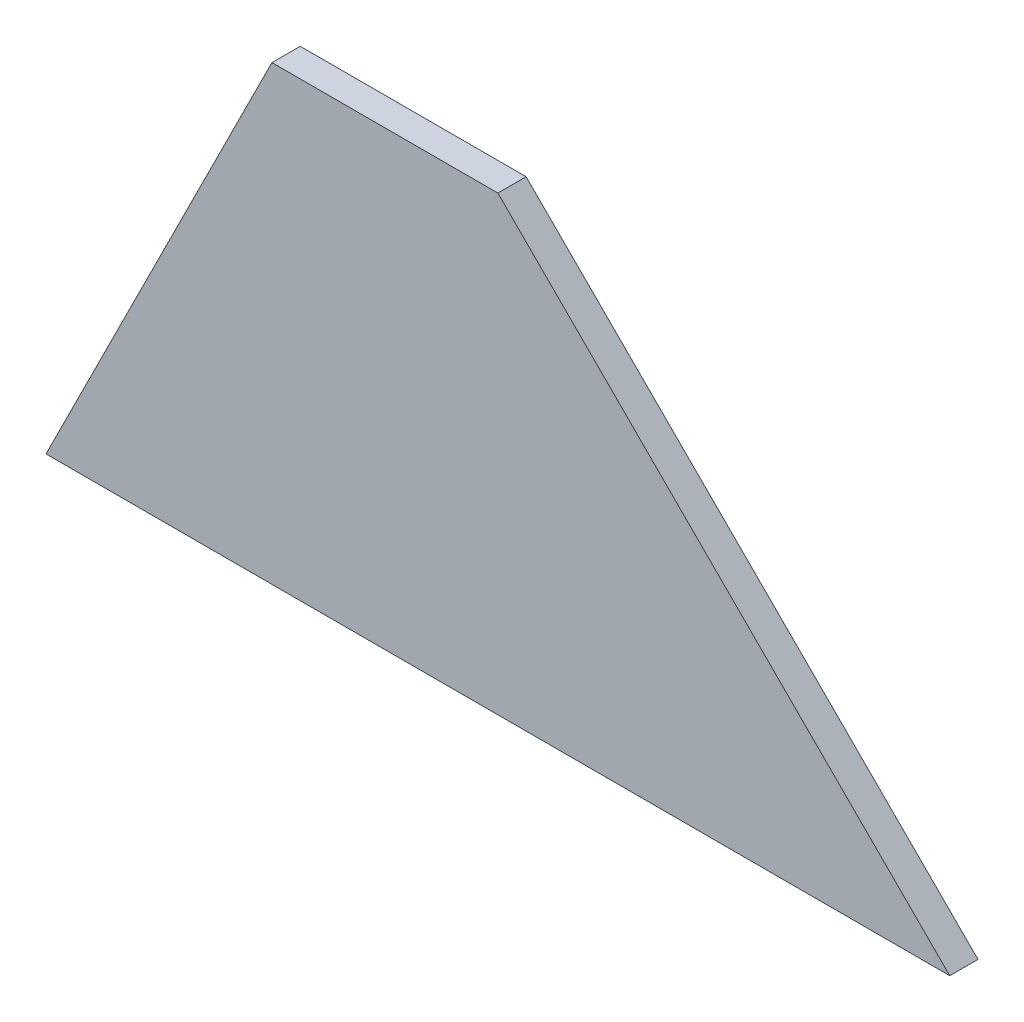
ISO-10303-21;
HEADER;
FILE_DESCRIPTION(('STEP AP214'),'2;1');
FILE_NAME('part.step','',(''),(''),'','','');
FILE_SCHEMA(('AUTOMOTIVE_DESIGN { 1 0 10303 214 1 1 1 1 }'));
ENDSEC;
DATA;
#1=APPLICATION_CONTEXT('core data for automotive mechanical design processes');
#2=APPLICATION_PROTOCOL_DEFINITION('international standard','automotive_design',2000,#1);
#3=PRODUCT_CONTEXT('',#1,'mechanical');
#4=PRODUCT('Part','Part','',(#3));
#5=PRODUCT_RELATED_PRODUCT_CATEGORY('part','',(#4));
#6=PRODUCT_DEFINITION_FORMATION('','',#4);
#7=PRODUCT_DEFINITION_CONTEXT('part definition',#1,'design');
#8=PRODUCT_DEFINITION('design','',#6,#7);
#9=PRODUCT_DEFINITION_SHAPE('','',#8);
#10=(LENGTH_UNIT() NAMED_UNIT(*) SI_UNIT(.MILLI.,.METRE.));
#11=(NAMED_UNIT(*) PLANE_ANGLE_UNIT() SI_UNIT($,.RADIAN.));
#12=(NAMED_UNIT(*) SI_UNIT($,.STERADIAN.) SOLID_ANGLE_UNIT());
#13=UNCERTAINTY_MEASURE_WITH_UNIT(LENGTH_MEASURE(1.E-05),#10,'distance_accuracy_value','');
#14=(GEOMETRIC_REPRESENTATION_CONTEXT(3) GLOBAL_UNCERTAINTY_ASSIGNED_CONTEXT((#13)) GLOBAL_UNIT_ASSIGNED_CONTEXT((#10,
#11,#12)) REPRESENTATION_CONTEXT('',''));
#15=CARTESIAN_POINT('',(0.,0.,0.));
#16=DIRECTION('',(0.,0.,1.));
#17=DIRECTION('',(1.,0.,0.));
#18=AXIS2_PLACEMENT_3D('',#15,#16,#17);
#19=CARTESIAN_POINT('',(-16.933333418,16.9333333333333,1.05833333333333));
#20=DIRECTION('',(-0.707106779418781,-0.707106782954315,0.));
#21=DIRECTION('',(0.707106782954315,-0.707106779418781,0.));
#22=AXIS2_PLACEMENT_3D('',#19,#20,#21);
#23=PLANE('',#22);
#24=DIRECTION('',(-0.707106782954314,0.70710677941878,0.));
#25=VECTOR('',#24,1.);
#26=CARTESIAN_POINT('',(-16.933333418,16.9333333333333,0.));
#27=LINE('',#26,#25);
#28=CARTESIAN_POINT('',(0.,0.,0.));
#29=VERTEX_POINT('',#28);
#30=CARTESIAN_POINT('',(-16.933333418,16.9333333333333,0.));
#31=VERTEX_POINT('',#30);
#32=EDGE_CURVE('E75',#29,#31,#27,.T.);
#33=ORIENTED_EDGE('',*,*,#32,.T.);
#34=DIRECTION('',(0.,0.,-1.));
#35=VECTOR('',#34,1.);
#36=CARTESIAN_POINT('',(-16.933333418,16.9333333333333,1.05833333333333));
#37=LINE('',#36,#35);
#38=CARTESIAN_POINT('',(-16.933333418,16.9333333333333,1.05833333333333));
#39=VERTEX_POINT('',#38);
#40=EDGE_CURVE('E11',#39,#31,#37,.T.);
#41=ORIENTED_EDGE('',*,*,#40,.F.);
#42=DIRECTION('',(-0.707106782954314,0.70710677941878,0.));
#43=VECTOR('',#42,1.);
#44=CARTESIAN_POINT('',(-16.933333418,16.9333333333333,1.05833333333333));
#45=LINE('',#44,#43);
#46=CARTESIAN_POINT('',(0.,0.,1.05833333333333));
#47=VERTEX_POINT('',#46);
#48=EDGE_CURVE('E93',#47,#39,#45,.T.);
#49=ORIENTED_EDGE('',*,*,#48,.F.);
#50=DIRECTION('',(0.,0.,-1.));
#51=VECTOR('',#50,1.);
#52=CARTESIAN_POINT('',(0.,0.,1.05833333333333));
#53=LINE('',#52,#51);
#54=EDGE_CURVE('E87',#47,#29,#53,.T.);
#55=ORIENTED_EDGE('',*,*,#54,.T.);
#56=EDGE_LOOP('',(#33,#41,#49,#55));
#57=FACE_BOUND('',#56,.T.);
#58=ADVANCED_FACE('F31',(#57),#23,.F.);
#59=CARTESIAN_POINT('',(-16.933333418,16.9333333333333,1.05833333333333));
#60=DIRECTION('',(0.,-1.,0.));
#61=DIRECTION('',(0.,0.,-1.));
#62=AXIS2_PLACEMENT_3D('',#59,#60,#61);
#63=PLANE('',#62);
#64=DIRECTION('',(-1.,0.,0.));
#65=VECTOR('',#64,1.);
#66=CARTESIAN_POINT('',(-16.933333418,16.9333333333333,0.));
#67=LINE('',#66,#65);
#68=CARTESIAN_POINT('',(-25.4,16.9333333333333,0.));
#69=VERTEX_POINT('',#68);
#70=EDGE_CURVE('E71',#31,#69,#67,.T.);
#71=ORIENTED_EDGE('',*,*,#70,.T.);
#72=DIRECTION('',(0.,0.,-1.));
#73=VECTOR('',#72,1.);
#74=CARTESIAN_POINT('',(-25.4,16.9333333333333,1.05833333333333));
#75=LINE('',#74,#73);
#76=CARTESIAN_POINT('',(-25.4,16.9333333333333,1.05833333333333));
#77=VERTEX_POINT('',#76);
#78=EDGE_CURVE('E38',#77,#69,#75,.T.);
#79=ORIENTED_EDGE('',*,*,#78,.F.);
#80=DIRECTION('',(-1.,0.,0.));
#81=VECTOR('',#80,1.);
#82=CARTESIAN_POINT('',(-16.933333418,16.9333333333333,1.05833333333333));
#83=LINE('',#82,#81);
#84=EDGE_CURVE('E83',#39,#77,#83,.T.);
#85=ORIENTED_EDGE('',*,*,#84,.F.);
#86=ORIENTED_EDGE('',*,*,#40,.T.);
#87=EDGE_LOOP('',(#71,#79,#85,#86));
#88=FACE_BOUND('',#87,.T.);
#89=ADVANCED_FACE('F82',(#88),#63,.F.);
#90=CARTESIAN_POINT('',(-33.8666666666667,0.,1.05833333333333));
#91=DIRECTION('',(0.894427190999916,-0.447213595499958,0.));
#92=DIRECTION('',(0.447213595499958,0.894427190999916,0.));
#93=AXIS2_PLACEMENT_3D('',#90,#91,#92);
#94=PLANE('',#93);
#95=DIRECTION('',(-0.447213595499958,-0.894427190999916,0.));
#96=VECTOR('',#95,1.);
#97=CARTESIAN_POINT('',(-33.8666666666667,0.,0.));
#98=LINE('',#97,#96);
#99=CARTESIAN_POINT('',(-33.8666666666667,0.,0.));
#100=VERTEX_POINT('',#99);
#101=EDGE_CURVE('E76',#69,#100,#98,.T.);
#102=ORIENTED_EDGE('',*,*,#101,.T.);
#103=DIRECTION('',(0.,0.,-1.));
#104=VECTOR('',#103,1.);
#105=CARTESIAN_POINT('',(-33.8666666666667,0.,1.05833333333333));
#106=LINE('',#105,#104);
#107=CARTESIAN_POINT('',(-33.8666666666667,0.,1.05833333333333));
#108=VERTEX_POINT('',#107);
#109=EDGE_CURVE('E99',#108,#100,#106,.T.);
#110=ORIENTED_EDGE('',*,*,#109,.F.);
#111=DIRECTION('',(-0.447213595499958,-0.894427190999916,0.));
#112=VECTOR('',#111,1.);
#113=CARTESIAN_POINT('',(-33.8666666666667,0.,1.05833333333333));
#114=LINE('',#113,#112);
#115=EDGE_CURVE('E50',#77,#108,#114,.T.);
#116=ORIENTED_EDGE('',*,*,#115,.F.);
#117=ORIENTED_EDGE('',*,*,#78,.T.);
#118=EDGE_LOOP('',(#102,#110,#116,#117));
#119=FACE_BOUND('',#118,.T.);
#120=ADVANCED_FACE('F102',(#119),#94,.F.);
#121=CARTESIAN_POINT('',(0.,0.,1.05833333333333));
#122=DIRECTION('',(0.,1.,0.));
#123=DIRECTION('',(-1.,0.,0.));
#124=AXIS2_PLACEMENT_3D('',#121,#122,#123);
#125=PLANE('',#124);
#126=DIRECTION('',(1.,0.,0.));
#127=VECTOR('',#126,1.);
#128=CARTESIAN_POINT('',(0.,0.,0.));
#129=LINE('',#128,#127);
#130=EDGE_CURVE('E91',#100,#29,#129,.T.);
#131=ORIENTED_EDGE('',*,*,#130,.T.);
#132=ORIENTED_EDGE('',*,*,#54,.F.);
#133=DIRECTION('',(1.,0.,0.));
#134=VECTOR('',#133,1.);
#135=CARTESIAN_POINT('',(0.,0.,1.05833333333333));
#136=LINE('',#135,#134);
#137=EDGE_CURVE('E45',#108,#47,#136,.T.);
#138=ORIENTED_EDGE('',*,*,#137,.F.);
#139=ORIENTED_EDGE('',*,*,#109,.T.);
#140=EDGE_LOOP('',(#131,#132,#138,#139));
#141=FACE_BOUND('',#140,.T.);
#142=ADVANCED_FACE('F104',(#141),#125,.F.);
#143=CARTESIAN_POINT('',(-22.5777778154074,22.5777777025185,1.05833333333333));
#144=DIRECTION('',(0.,0.,1.));
#145=DIRECTION('',(1.,0.,0.));
#146=AXIS2_PLACEMENT_3D('',#143,#144,#145);
#147=PLANE('',#146);
#148=ORIENTED_EDGE('',*,*,#48,.T.);
#149=ORIENTED_EDGE('',*,*,#84,.T.);
#150=ORIENTED_EDGE('',*,*,#115,.T.);
#151=ORIENTED_EDGE('',*,*,#137,.T.);
#152=EDGE_LOOP('',(#148,#149,#150,#151));
#153=FACE_BOUND('',#152,.T.);
#154=ADVANCED_FACE('F105',(#153),#147,.T.);
#155=CARTESIAN_POINT('',(-22.5777778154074,22.5777777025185,0.));
#156=DIRECTION('',(0.,0.,1.));
#157=DIRECTION('',(1.,0.,0.));
#158=AXIS2_PLACEMENT_3D('',#155,#156,#157);
#159=PLANE('',#158);
#160=ORIENTED_EDGE('',*,*,#32,.F.);
#161=ORIENTED_EDGE('',*,*,#130,.F.);
#162=ORIENTED_EDGE('',*,*,#101,.F.);
#163=ORIENTED_EDGE('',*,*,#70,.F.);
#164=EDGE_LOOP('',(#160,#161,#162,#163));
#165=FACE_BOUND('',#164,.T.);
#166=ADVANCED_FACE('F72',(#165),#159,.F.);
#167=CLOSED_SHELL('',(#58,#89,#120,#142,#154,#166));
#168=MANIFOLD_SOLID_BREP('B2',#167);
#169=ADVANCED_BREP_SHAPE_REPRESENTATION('',(#18,#168),#14);
#170=SHAPE_DEFINITION_REPRESENTATION(#9,#169);
ENDSEC;
END-ISO-10303-21;
